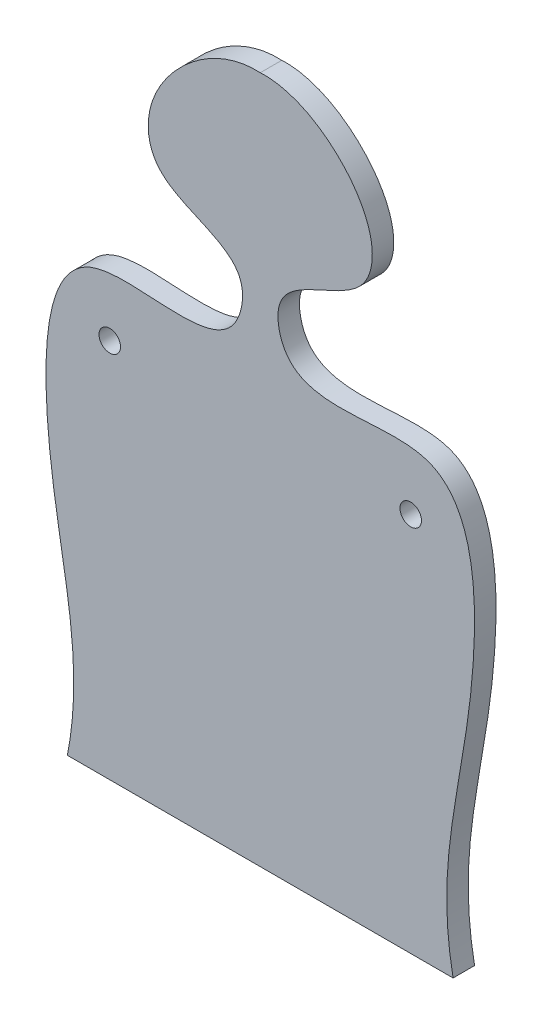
ISO-10303-21;
HEADER;
FILE_DESCRIPTION(('STEP AP214'),'2;1');
FILE_NAME('part.step','',(''),(''),'','','');
FILE_SCHEMA(('AUTOMOTIVE_DESIGN { 1 0 10303 214 1 1 1 1 }'));
ENDSEC;
DATA;
#1=APPLICATION_CONTEXT('core data for automotive mechanical design processes');
#2=APPLICATION_PROTOCOL_DEFINITION('international standard','automotive_design',2000,#1);
#3=PRODUCT_CONTEXT('',#1,'mechanical');
#4=PRODUCT('Part','Part','',(#3));
#5=PRODUCT_RELATED_PRODUCT_CATEGORY('part','',(#4));
#6=PRODUCT_DEFINITION_FORMATION('','',#4);
#7=PRODUCT_DEFINITION_CONTEXT('part definition',#1,'design');
#8=PRODUCT_DEFINITION('design','',#6,#7);
#9=PRODUCT_DEFINITION_SHAPE('','',#8);
#10=(LENGTH_UNIT() NAMED_UNIT(*) SI_UNIT(.MILLI.,.METRE.));
#11=(NAMED_UNIT(*) PLANE_ANGLE_UNIT() SI_UNIT($,.RADIAN.));
#12=(NAMED_UNIT(*) SI_UNIT($,.STERADIAN.) SOLID_ANGLE_UNIT());
#13=UNCERTAINTY_MEASURE_WITH_UNIT(LENGTH_MEASURE(1.E-05),#10,'distance_accuracy_value','');
#14=(GEOMETRIC_REPRESENTATION_CONTEXT(3) GLOBAL_UNCERTAINTY_ASSIGNED_CONTEXT((#13)) GLOBAL_UNIT_ASSIGNED_CONTEXT((#10,
#11,#12)) REPRESENTATION_CONTEXT('',''));
#15=CARTESIAN_POINT('',(0.,0.,0.));
#16=DIRECTION('',(0.,0.,1.));
#17=DIRECTION('',(1.,0.,0.));
#18=AXIS2_PLACEMENT_3D('',#15,#16,#17);
#19=CARTESIAN_POINT('',(24.5279225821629,64.3639870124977,3.175));
#20=DIRECTION('',(0.,0.,1.));
#21=DIRECTION('',(1.,0.,0.));
#22=AXIS2_PLACEMENT_3D('',#19,#20,#21);
#23=PLANE('',#22);
#24=CARTESIAN_POINT('',(-22.2358139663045,56.1946163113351,3.175));
#25=DIRECTION('',(0.,0.,1.));
#26=DIRECTION('',(1.,0.,0.));
#27=AXIS2_PLACEMENT_3D('',#24,#25,#26);
#28=CIRCLE('',#27,1.5875);
#29=CARTESIAN_POINT('',(-20.6483139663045,56.1946163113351,3.175));
#30=VERTEX_POINT('',#29);
#31=EDGE_CURVE('E83',#30,#30,#28,.T.);
#32=ORIENTED_EDGE('',*,*,#31,.F.);
#33=EDGE_LOOP('',(#32));
#34=FACE_BOUND('',#33,.T.);
#35=CARTESIAN_POINT('',(28.4958775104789,0.,3.175));
#36=CARTESIAN_POINT('',(25.5121806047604,15.3130633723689,3.175));
#37=CARTESIAN_POINT('',(33.1539776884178,31.6367173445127,3.175));
#38=CARTESIAN_POINT('',(30.895089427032,71.6036471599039,3.175));
#39=CARTESIAN_POINT('',(4.38336134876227,60.6032837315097,3.175));
#40=CARTESIAN_POINT('',(1.21032220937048,77.7137287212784,3.175));
#41=CARTESIAN_POINT('',(16.0609021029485,78.4871297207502,3.175));
#42=CARTESIAN_POINT('',(17.572050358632,92.8672299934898,3.175));
#43=CARTESIAN_POINT('',(6.86377709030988,102.01642845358,3.175));
#44=CARTESIAN_POINT('',(0.,101.6,3.175));
#45=B_SPLINE_CURVE_WITH_KNOTS('',3,(#35,#36,#37,#38,#39,#40,#41,#42,#43,#44),.UNSPECIFIED.,.F.,
.F.,(4,1,1,1,1,1,1,4),(0.,0.324810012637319,0.495542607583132,0.659809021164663,
0.701212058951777,0.816034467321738,0.873603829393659,1.),.UNSPECIFIED.);
#46=CARTESIAN_POINT('',(28.4958775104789,0.,3.175));
#47=VERTEX_POINT('',#46);
#48=CARTESIAN_POINT('',(0.,101.6,3.175));
#49=VERTEX_POINT('',#48);
#50=EDGE_CURVE('E74',#47,#49,#45,.T.);
#51=ORIENTED_EDGE('',*,*,#50,.T.);
#52=CARTESIAN_POINT('',(0.,101.6,3.175));
#53=CARTESIAN_POINT('',(-6.86377709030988,102.01642845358,3.175));
#54=CARTESIAN_POINT('',(-17.572050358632,92.8672299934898,3.175));
#55=CARTESIAN_POINT('',(-16.0609021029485,78.4871297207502,3.175));
#56=CARTESIAN_POINT('',(-1.21032220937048,77.7137287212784,3.175));
#57=CARTESIAN_POINT('',(-4.38336134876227,60.6032837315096,3.175));
#58=CARTESIAN_POINT('',(-30.895089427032,71.6036471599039,3.175));
#59=CARTESIAN_POINT('',(-33.1539776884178,31.6367173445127,3.175));
#60=CARTESIAN_POINT('',(-25.5121806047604,15.3130633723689,3.175));
#61=CARTESIAN_POINT('',(-28.4958775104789,0.,3.175));
#62=B_SPLINE_CURVE_WITH_KNOTS('',3,(#52,#53,#54,#55,#56,#57,#58,#59,#60,#61),.UNSPECIFIED.,.F.,
.F.,(4,1,1,1,1,1,1,4),(0.,0.126396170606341,0.183965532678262,0.298787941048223,
0.340190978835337,0.504457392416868,0.675189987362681,1.),.UNSPECIFIED.);
#63=CARTESIAN_POINT('',(-28.4958775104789,0.,3.175));
#64=VERTEX_POINT('',#63);
#65=EDGE_CURVE('E70',#49,#64,#62,.T.);
#66=ORIENTED_EDGE('',*,*,#65,.T.);
#67=DIRECTION('',(1.,0.,0.));
#68=VECTOR('',#67,1.);
#69=CARTESIAN_POINT('',(28.4958775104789,0.,3.175));
#70=LINE('',#69,#68);
#71=EDGE_CURVE('E50',#64,#47,#70,.T.);
#72=ORIENTED_EDGE('',*,*,#71,.T.);
#73=EDGE_LOOP('',(#51,#66,#72));
#74=FACE_BOUND('',#73,.T.);
#75=CARTESIAN_POINT('',(22.2358139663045,56.1946163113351,3.175));
#76=DIRECTION('',(0.,0.,1.));
#77=DIRECTION('',(-1.,0.,0.));
#78=AXIS2_PLACEMENT_3D('',#75,#76,#77);
#79=CIRCLE('',#78,1.5875);
#80=CARTESIAN_POINT('',(20.6483139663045,56.1946163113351,3.175));
#81=VERTEX_POINT('',#80);
#82=EDGE_CURVE('E114',#81,#81,#79,.T.);
#83=ORIENTED_EDGE('',*,*,#82,.F.);
#84=EDGE_LOOP('',(#83));
#85=FACE_BOUND('',#84,.T.);
#86=ADVANCED_FACE('F32',(#34,#74,#85),#23,.T.);
#87=CARTESIAN_POINT('',(24.5279225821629,64.3639870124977,0.));
#88=DIRECTION('',(0.,0.,1.));
#89=DIRECTION('',(1.,0.,0.));
#90=AXIS2_PLACEMENT_3D('',#87,#88,#89);
#91=PLANE('',#90);
#92=CARTESIAN_POINT('',(28.4958775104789,0.,0.));
#93=CARTESIAN_POINT('',(25.5121806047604,15.3130633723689,0.));
#94=CARTESIAN_POINT('',(33.1539776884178,31.6367173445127,0.));
#95=CARTESIAN_POINT('',(30.895089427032,71.6036471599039,0.));
#96=CARTESIAN_POINT('',(4.38336134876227,60.6032837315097,0.));
#97=CARTESIAN_POINT('',(1.21032220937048,77.7137287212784,0.));
#98=CARTESIAN_POINT('',(16.0609021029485,78.4871297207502,0.));
#99=CARTESIAN_POINT('',(17.572050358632,92.8672299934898,0.));
#100=CARTESIAN_POINT('',(6.86377709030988,102.01642845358,0.));
#101=CARTESIAN_POINT('',(0.,101.6,0.));
#102=B_SPLINE_CURVE_WITH_KNOTS('',3,(#92,#93,#94,#95,#96,#97,#98,#99,#100,#101),.UNSPECIFIED.,
.F.,.F.,(4,1,1,1,1,1,1,4),(0.,0.324810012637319,0.495542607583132,0.659809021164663,
0.701212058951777,0.816034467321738,0.873603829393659,1.),.UNSPECIFIED.);
#103=CARTESIAN_POINT('',(28.4958775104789,0.,0.));
#104=VERTEX_POINT('',#103);
#105=CARTESIAN_POINT('',(0.,101.6,0.));
#106=VERTEX_POINT('',#105);
#107=EDGE_CURVE('E80',#104,#106,#102,.T.);
#108=ORIENTED_EDGE('',*,*,#107,.F.);
#109=DIRECTION('',(1.,0.,0.));
#110=VECTOR('',#109,1.);
#111=CARTESIAN_POINT('',(28.4958775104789,0.,0.));
#112=LINE('',#111,#110);
#113=CARTESIAN_POINT('',(-28.4958775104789,0.,0.));
#114=VERTEX_POINT('',#113);
#115=EDGE_CURVE('E67',#114,#104,#112,.T.);
#116=ORIENTED_EDGE('',*,*,#115,.F.);
#117=CARTESIAN_POINT('',(0.,101.6,0.));
#118=CARTESIAN_POINT('',(-6.86377709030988,102.01642845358,0.));
#119=CARTESIAN_POINT('',(-17.572050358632,92.8672299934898,0.));
#120=CARTESIAN_POINT('',(-16.0609021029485,78.4871297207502,0.));
#121=CARTESIAN_POINT('',(-1.21032220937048,77.7137287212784,0.));
#122=CARTESIAN_POINT('',(-4.38336134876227,60.6032837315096,0.));
#123=CARTESIAN_POINT('',(-30.895089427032,71.6036471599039,0.));
#124=CARTESIAN_POINT('',(-33.1539776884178,31.6367173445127,0.));
#125=CARTESIAN_POINT('',(-25.5121806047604,15.3130633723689,0.));
#126=CARTESIAN_POINT('',(-28.4958775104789,0.,0.));
#127=B_SPLINE_CURVE_WITH_KNOTS('',3,(#117,#118,#119,#120,#121,#122,#123,#124,#125,#126),
.UNSPECIFIED.,.F.,.F.,(4,1,1,1,1,1,1,4),(0.,0.126396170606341,0.183965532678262,
0.298787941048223,0.340190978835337,0.504457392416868,0.675189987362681,1.),.UNSPECIFIED.);
#128=EDGE_CURVE('E62',#106,#114,#127,.T.);
#129=ORIENTED_EDGE('',*,*,#128,.F.);
#130=EDGE_LOOP('',(#108,#116,#129));
#131=FACE_BOUND('',#130,.T.);
#132=CARTESIAN_POINT('',(-22.2358139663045,56.1946163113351,0.));
#133=DIRECTION('',(0.,0.,1.));
#134=DIRECTION('',(1.,0.,0.));
#135=AXIS2_PLACEMENT_3D('',#132,#133,#134);
#136=CIRCLE('',#135,1.5875);
#137=CARTESIAN_POINT('',(-20.6483139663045,56.1946163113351,0.));
#138=VERTEX_POINT('',#137);
#139=EDGE_CURVE('E87',#138,#138,#136,.T.);
#140=ORIENTED_EDGE('',*,*,#139,.T.);
#141=EDGE_LOOP('',(#140));
#142=FACE_BOUND('',#141,.T.);
#143=CARTESIAN_POINT('',(22.2358139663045,56.1946163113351,0.));
#144=DIRECTION('',(0.,0.,1.));
#145=DIRECTION('',(-1.,0.,0.));
#146=AXIS2_PLACEMENT_3D('',#143,#144,#145);
#147=CIRCLE('',#146,1.5875);
#148=CARTESIAN_POINT('',(20.6483139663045,56.1946163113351,0.));
#149=VERTEX_POINT('',#148);
#150=EDGE_CURVE('E112',#149,#149,#147,.T.);
#151=ORIENTED_EDGE('',*,*,#150,.T.);
#152=EDGE_LOOP('',(#151));
#153=FACE_BOUND('',#152,.T.);
#154=ADVANCED_FACE('F103',(#131,#142,#153),#91,.F.);
#155=DIRECTION('',(0.,0.,-1.));
#156=VECTOR('',#155,1.);
#157=SURFACE_OF_LINEAR_EXTRUSION('',#45,#156);
#158=ORIENTED_EDGE('',*,*,#107,.T.);
#159=DIRECTION('',(0.,0.,-1.));
#160=VECTOR('',#159,1.);
#161=CARTESIAN_POINT('',(0.,101.6,3.175));
#162=LINE('',#161,#160);
#163=EDGE_CURVE('E11',#49,#106,#162,.T.);
#164=ORIENTED_EDGE('',*,*,#163,.F.);
#165=ORIENTED_EDGE('',*,*,#50,.F.);
#166=DIRECTION('',(0.,0.,-1.));
#167=VECTOR('',#166,1.);
#168=CARTESIAN_POINT('',(28.4958775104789,0.,3.175));
#169=LINE('',#168,#167);
#170=EDGE_CURVE('E81',#47,#104,#169,.T.);
#171=ORIENTED_EDGE('',*,*,#170,.T.);
#172=EDGE_LOOP('',(#158,#164,#165,#171));
#173=FACE_BOUND('',#172,.T.);
#174=ADVANCED_FACE('F34',(#173),#157,.F.);
#175=DIRECTION('',(0.,0.,-1.));
#176=VECTOR('',#175,1.);
#177=SURFACE_OF_LINEAR_EXTRUSION('',#62,#176);
#178=ORIENTED_EDGE('',*,*,#128,.T.);
#179=DIRECTION('',(0.,0.,-1.));
#180=VECTOR('',#179,1.);
#181=CARTESIAN_POINT('',(-28.4958775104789,0.,3.175));
#182=LINE('',#181,#180);
#183=EDGE_CURVE('E42',#64,#114,#182,.T.);
#184=ORIENTED_EDGE('',*,*,#183,.F.);
#185=ORIENTED_EDGE('',*,*,#65,.F.);
#186=ORIENTED_EDGE('',*,*,#163,.T.);
#187=EDGE_LOOP('',(#178,#184,#185,#186));
#188=FACE_BOUND('',#187,.T.);
#189=ADVANCED_FACE('F71',(#188),#177,.F.);
#190=CARTESIAN_POINT('',(28.4958775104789,0.,3.175));
#191=DIRECTION('',(0.,1.,0.));
#192=DIRECTION('',(0.,0.,1.));
#193=AXIS2_PLACEMENT_3D('',#190,#191,#192);
#194=PLANE('',#193);
#195=ORIENTED_EDGE('',*,*,#115,.T.);
#196=ORIENTED_EDGE('',*,*,#170,.F.);
#197=ORIENTED_EDGE('',*,*,#71,.F.);
#198=ORIENTED_EDGE('',*,*,#183,.T.);
#199=EDGE_LOOP('',(#195,#196,#197,#198));
#200=FACE_BOUND('',#199,.T.);
#201=ADVANCED_FACE('F102',(#200),#194,.F.);
#202=CARTESIAN_POINT('',(-22.2358139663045,56.1946163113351,3.175));
#203=DIRECTION('',(0.,0.,-1.));
#204=DIRECTION('',(-1.,0.,0.));
#205=AXIS2_PLACEMENT_3D('',#202,#203,#204);
#206=CYLINDRICAL_SURFACE('',#205,1.5875);
#207=ORIENTED_EDGE('',*,*,#31,.T.);
#208=EDGE_LOOP('',(#207));
#209=FACE_BOUND('',#208,.T.);
#210=ORIENTED_EDGE('',*,*,#139,.F.);
#211=EDGE_LOOP('',(#210));
#212=FACE_BOUND('',#211,.T.);
#213=ADVANCED_FACE('F134',(#209,#212),#206,.F.);
#214=CARTESIAN_POINT('',(22.2358139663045,56.1946163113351,3.175));
#215=DIRECTION('',(0.,0.,-1.));
#216=DIRECTION('',(-1.,0.,0.));
#217=AXIS2_PLACEMENT_3D('',#214,#215,#216);
#218=CYLINDRICAL_SURFACE('',#217,1.5875);
#219=ORIENTED_EDGE('',*,*,#82,.T.);
#220=EDGE_LOOP('',(#219));
#221=FACE_BOUND('',#220,.T.);
#222=ORIENTED_EDGE('',*,*,#150,.F.);
#223=EDGE_LOOP('',(#222));
#224=FACE_BOUND('',#223,.T.);
#225=ADVANCED_FACE('F141',(#221,#224),#218,.F.);
#226=CLOSED_SHELL('',(#86,#154,#174,#189,#201,#213,#225));
#227=MANIFOLD_SOLID_BREP('B2',#226);
#228=ADVANCED_BREP_SHAPE_REPRESENTATION('',(#18,#227),#14);
#229=SHAPE_DEFINITION_REPRESENTATION(#9,#228);
ENDSEC;
END-ISO-10303-21;
